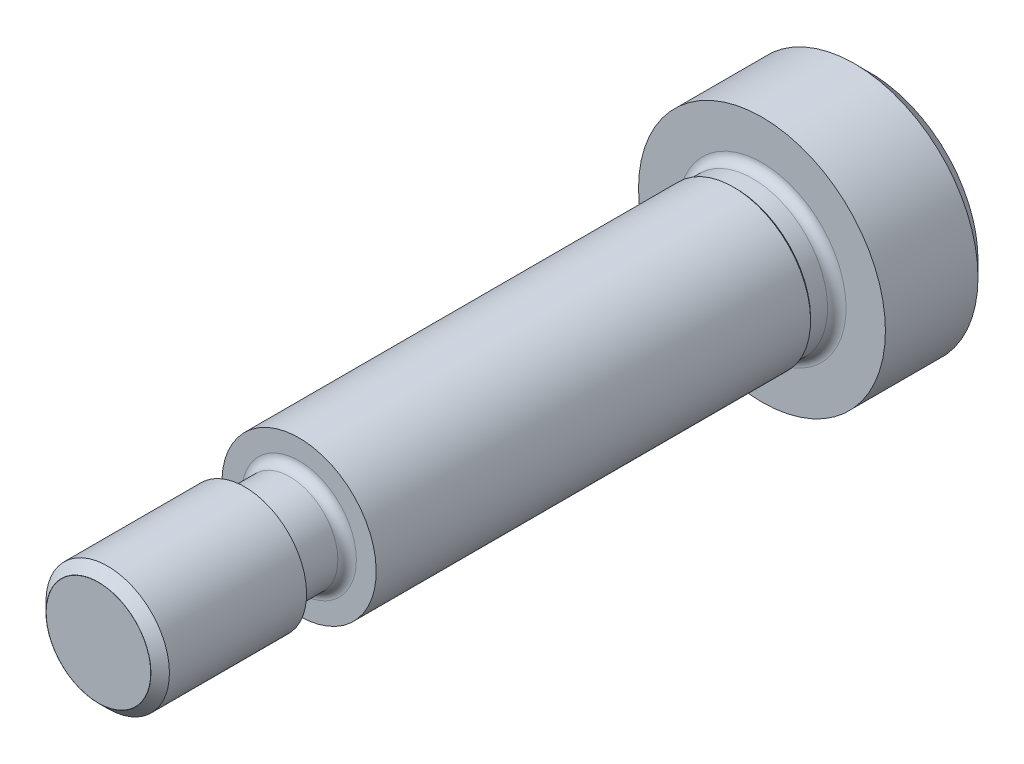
from build123d import *

# Parameters (mm, degrees)
CUT_EXTRUDE1_DEPTH = 4


with BuildPart() as part:
    # Sketch1 → Revolve1 (revolve)
    with BuildSketch(Plane(origin=(0, 0, 0), x_dir=(0, 0, -1), z_dir=(1, 0, 0)), mode=Mode.PRIVATE) as revolve1_sk:
        with BuildLine():
            Line((7, 2.5), (7, 7))
            Line((7, 7), (6, 8))
            Line((6, 8), (0, 8))
            Line((0, 8), (0, 5.45))
            ThreePointArc((0, 5.45), (-0.175735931, 5.025735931), (-0.6, 4.85))
            Line((-0.6, 4.85), (-1.7, 4.85))
            Line((-1.7, 4.85), (-1.85, 5))
            Line((-1.85, 5), (-30, 5))
            Line((-30, 5), (-30, 3.715))
            ThreePointArc((-30, 3.715), (-30.175735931, 3.290735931), (-30.6, 3.115))
            Line((-30.6, 3.115), (-33, 3.115))
            Line((-33, 3.115), (-33.510954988, 4))
            Line((-33.510954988, 4), (-42.4, 4))
            Line((-42.4, 4), (-43, 3.4))
            Line((-43, 3.4), (-33.176091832, 3.4))
            Line((-33.176091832, 3.4), (-33.170318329, 3.39))
            Line((-33.170318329, 3.39), (-43, 3.39))
            Line((-43, 3.39), (-43, 0))
            Line((-43, 0), (1.497848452, 0))
            Line((1.497848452, 0), (3, 2.5))
            Line((3, 2.5), (7, 2.5))
        make_face()
    revolve(revolve1_sk.sketch.rotate(Axis((0, 0, -1.497848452), (0, 0, -1)), 180), axis=Axis((0, 0, -1.497848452), (0, 0, -1)))

    # Sketch2 → Cut-Extrude1 (cut)
    with BuildSketch(Plane(origin=(0, 0, -7), x_dir=(-1, 0, 0), z_dir=(0, 0, -1))):
        Polygon((1.443375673, -2.5), (2.886751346, 0), (1.443375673, 2.5), (-1.443375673, 2.5), (-2.886751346, 0), (-1.443375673, -2.5), align=None)
    extrude(amount=-CUT_EXTRUDE1_DEPTH, mode=Mode.SUBTRACT)


solid = part.part
